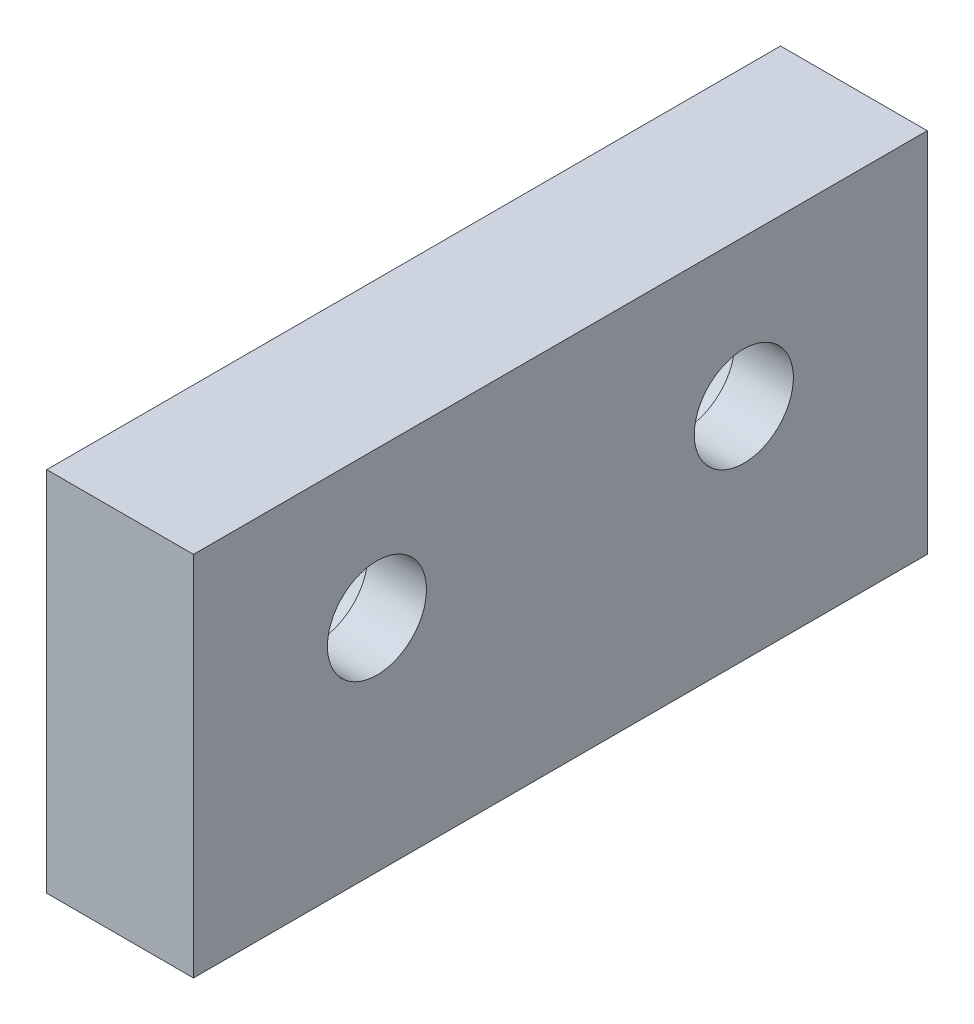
ISO-10303-21;
HEADER;
FILE_DESCRIPTION(('STEP AP214'),'2;1');
FILE_NAME('part.step','',(''),(''),'','','');
FILE_SCHEMA(('AUTOMOTIVE_DESIGN { 1 0 10303 214 1 1 1 1 }'));
ENDSEC;
DATA;
#1=APPLICATION_CONTEXT('core data for automotive mechanical design processes');
#2=APPLICATION_PROTOCOL_DEFINITION('international standard','automotive_design',2000,#1);
#3=PRODUCT_CONTEXT('',#1,'mechanical');
#4=PRODUCT('Part','Part','',(#3));
#5=PRODUCT_RELATED_PRODUCT_CATEGORY('part','',(#4));
#6=PRODUCT_DEFINITION_FORMATION('','',#4);
#7=PRODUCT_DEFINITION_CONTEXT('part definition',#1,'design');
#8=PRODUCT_DEFINITION('design','',#6,#7);
#9=PRODUCT_DEFINITION_SHAPE('','',#8);
#10=(LENGTH_UNIT() NAMED_UNIT(*) SI_UNIT(.MILLI.,.METRE.));
#11=(NAMED_UNIT(*) PLANE_ANGLE_UNIT() SI_UNIT($,.RADIAN.));
#12=(NAMED_UNIT(*) SI_UNIT($,.STERADIAN.) SOLID_ANGLE_UNIT());
#13=UNCERTAINTY_MEASURE_WITH_UNIT(LENGTH_MEASURE(1.E-05),#10,'distance_accuracy_value','');
#14=(GEOMETRIC_REPRESENTATION_CONTEXT(3) GLOBAL_UNCERTAINTY_ASSIGNED_CONTEXT((#13)) GLOBAL_UNIT_ASSIGNED_CONTEXT((#10,
#11,#12)) REPRESENTATION_CONTEXT('',''));
#15=CARTESIAN_POINT('',(0.,0.,0.));
#16=DIRECTION('',(0.,0.,1.));
#17=DIRECTION('',(1.,0.,0.));
#18=AXIS2_PLACEMENT_3D('',#15,#16,#17);
#19=CARTESIAN_POINT('',(-20.,20.,-25.));
#20=DIRECTION('',(-1.,0.,0.));
#21=DIRECTION('',(0.,-1.,0.));
#22=AXIS2_PLACEMENT_3D('',#19,#20,#21);
#23=PLANE('',#22);
#24=CARTESIAN_POINT('',(-20.,0.,0.));
#25=DIRECTION('',(-1.,0.,0.));
#26=DIRECTION('',(0.,0.,1.));
#27=AXIS2_PLACEMENT_3D('',#24,#25,#26);
#28=CIRCLE('',#27,10.);
#29=CARTESIAN_POINT('',(-20.,0.,10.));
#30=VERTEX_POINT('',#29);
#31=EDGE_CURVE('E132',#30,#30,#28,.T.);
#32=ORIENTED_EDGE('',*,*,#31,.F.);
#33=EDGE_LOOP('',(#32));
#34=FACE_BOUND('',#33,.T.);
#35=CARTESIAN_POINT('',(-20.,0.,50.));
#36=DIRECTION('',(-1.,0.,0.));
#37=DIRECTION('',(0.,0.,1.));
#38=AXIS2_PLACEMENT_3D('',#35,#36,#37);
#39=CIRCLE('',#38,10.);
#40=CARTESIAN_POINT('',(-20.,0.,60.));
#41=VERTEX_POINT('',#40);
#42=EDGE_CURVE('E135',#41,#41,#39,.T.);
#43=ORIENTED_EDGE('',*,*,#42,.F.);
#44=EDGE_LOOP('',(#43));
#45=FACE_BOUND('',#44,.T.);
#46=DIRECTION('',(0.,0.,1.));
#47=VECTOR('',#46,1.);
#48=CARTESIAN_POINT('',(-20.,-30.,-25.));
#49=LINE('',#48,#47);
#50=CARTESIAN_POINT('',(-20.,-30.,-25.));
#51=VERTEX_POINT('',#50);
#52=CARTESIAN_POINT('',(-20.,-30.,75.));
#53=VERTEX_POINT('',#52);
#54=EDGE_CURVE('E38',#51,#53,#49,.T.);
#55=ORIENTED_EDGE('',*,*,#54,.T.);
#56=DIRECTION('',(0.,-1.,0.));
#57=VECTOR('',#56,1.);
#58=CARTESIAN_POINT('',(-20.,20.,75.));
#59=LINE('',#58,#57);
#60=CARTESIAN_POINT('',(-20.,20.,75.));
#61=VERTEX_POINT('',#60);
#62=EDGE_CURVE('E75',#61,#53,#59,.T.);
#63=ORIENTED_EDGE('',*,*,#62,.F.);
#64=DIRECTION('',(0.,0.,1.));
#65=VECTOR('',#64,1.);
#66=CARTESIAN_POINT('',(-20.,20.,-25.));
#67=LINE('',#66,#65);
#68=CARTESIAN_POINT('',(-20.,20.,-25.));
#69=VERTEX_POINT('',#68);
#70=EDGE_CURVE('E11',#69,#61,#67,.T.);
#71=ORIENTED_EDGE('',*,*,#70,.F.);
#72=DIRECTION('',(0.,-1.,0.));
#73=VECTOR('',#72,1.);
#74=CARTESIAN_POINT('',(-20.,20.,-25.));
#75=LINE('',#74,#73);
#76=EDGE_CURVE('E76',#69,#51,#75,.T.);
#77=ORIENTED_EDGE('',*,*,#76,.T.);
#78=EDGE_LOOP('',(#55,#63,#71,#77));
#79=FACE_BOUND('',#78,.T.);
#80=ADVANCED_FACE('F35',(#34,#45,#79),#23,.T.);
#81=CARTESIAN_POINT('',(-20.,20.,-25.));
#82=DIRECTION('',(0.,1.,0.));
#83=DIRECTION('',(-1.,0.,0.));
#84=AXIS2_PLACEMENT_3D('',#81,#82,#83);
#85=PLANE('',#84);
#86=ORIENTED_EDGE('',*,*,#70,.T.);
#87=DIRECTION('',(-1.,0.,0.));
#88=VECTOR('',#87,1.);
#89=CARTESIAN_POINT('',(-20.,20.,75.));
#90=LINE('',#89,#88);
#91=CARTESIAN_POINT('',(0.,20.,75.));
#92=VERTEX_POINT('',#91);
#93=EDGE_CURVE('E92',#92,#61,#90,.T.);
#94=ORIENTED_EDGE('',*,*,#93,.F.);
#95=DIRECTION('',(0.,0.,1.));
#96=VECTOR('',#95,1.);
#97=CARTESIAN_POINT('',(0.,20.,-25.));
#98=LINE('',#97,#96);
#99=CARTESIAN_POINT('',(0.,20.,-25.));
#100=VERTEX_POINT('',#99);
#101=EDGE_CURVE('E43',#100,#92,#98,.T.);
#102=ORIENTED_EDGE('',*,*,#101,.F.);
#103=DIRECTION('',(-1.,0.,0.));
#104=VECTOR('',#103,1.);
#105=CARTESIAN_POINT('',(-20.,20.,-25.));
#106=LINE('',#105,#104);
#107=EDGE_CURVE('E81',#100,#69,#106,.T.);
#108=ORIENTED_EDGE('',*,*,#107,.T.);
#109=EDGE_LOOP('',(#86,#94,#102,#108));
#110=FACE_BOUND('',#109,.T.);
#111=ADVANCED_FACE('F112',(#110),#85,.T.);
#112=CARTESIAN_POINT('',(0.,20.,-25.));
#113=DIRECTION('',(1.,0.,0.));
#114=DIRECTION('',(0.,1.,0.));
#115=AXIS2_PLACEMENT_3D('',#112,#113,#114);
#116=PLANE('',#115);
#117=CARTESIAN_POINT('',(0.,0.,0.));
#118=DIRECTION('',(-1.,0.,0.));
#119=DIRECTION('',(0.,0.,1.));
#120=AXIS2_PLACEMENT_3D('',#117,#118,#119);
#121=CIRCLE('',#120,6.75);
#122=CARTESIAN_POINT('',(0.,0.,6.75));
#123=VERTEX_POINT('',#122);
#124=EDGE_CURVE('E138',#123,#123,#121,.T.);
#125=ORIENTED_EDGE('',*,*,#124,.T.);
#126=EDGE_LOOP('',(#125));
#127=FACE_BOUND('',#126,.T.);
#128=CARTESIAN_POINT('',(0.,0.,50.));
#129=DIRECTION('',(-1.,0.,0.));
#130=DIRECTION('',(0.,0.,1.));
#131=AXIS2_PLACEMENT_3D('',#128,#129,#130);
#132=CIRCLE('',#131,6.75);
#133=CARTESIAN_POINT('',(0.,0.,56.75));
#134=VERTEX_POINT('',#133);
#135=EDGE_CURVE('E93',#134,#134,#132,.T.);
#136=ORIENTED_EDGE('',*,*,#135,.T.);
#137=EDGE_LOOP('',(#136));
#138=FACE_BOUND('',#137,.T.);
#139=ORIENTED_EDGE('',*,*,#101,.T.);
#140=DIRECTION('',(0.,1.,0.));
#141=VECTOR('',#140,1.);
#142=CARTESIAN_POINT('',(0.,20.,75.));
#143=LINE('',#142,#141);
#144=CARTESIAN_POINT('',(0.,-30.,75.));
#145=VERTEX_POINT('',#144);
#146=EDGE_CURVE('E88',#145,#92,#143,.T.);
#147=ORIENTED_EDGE('',*,*,#146,.F.);
#148=DIRECTION('',(0.,0.,1.));
#149=VECTOR('',#148,1.);
#150=CARTESIAN_POINT('',(0.,-30.,-25.));
#151=LINE('',#150,#149);
#152=CARTESIAN_POINT('',(0.,-30.,-25.));
#153=VERTEX_POINT('',#152);
#154=EDGE_CURVE('E80',#153,#145,#151,.T.);
#155=ORIENTED_EDGE('',*,*,#154,.F.);
#156=DIRECTION('',(0.,1.,0.));
#157=VECTOR('',#156,1.);
#158=CARTESIAN_POINT('',(0.,20.,-25.));
#159=LINE('',#158,#157);
#160=EDGE_CURVE('E105',#153,#100,#159,.T.);
#161=ORIENTED_EDGE('',*,*,#160,.T.);
#162=EDGE_LOOP('',(#139,#147,#155,#161));
#163=FACE_BOUND('',#162,.T.);
#164=ADVANCED_FACE('F109',(#127,#138,#163),#116,.T.);
#165=CARTESIAN_POINT('',(-20.,-30.,-25.));
#166=DIRECTION('',(0.,-1.,0.));
#167=DIRECTION('',(0.,0.,-1.));
#168=AXIS2_PLACEMENT_3D('',#165,#166,#167);
#169=PLANE('',#168);
#170=ORIENTED_EDGE('',*,*,#154,.T.);
#171=DIRECTION('',(1.,0.,0.));
#172=VECTOR('',#171,1.);
#173=CARTESIAN_POINT('',(-20.,-30.,75.));
#174=LINE('',#173,#172);
#175=EDGE_CURVE('E83',#53,#145,#174,.T.);
#176=ORIENTED_EDGE('',*,*,#175,.F.);
#177=ORIENTED_EDGE('',*,*,#54,.F.);
#178=DIRECTION('',(1.,0.,0.));
#179=VECTOR('',#178,1.);
#180=CARTESIAN_POINT('',(-20.,-30.,-25.));
#181=LINE('',#180,#179);
#182=EDGE_CURVE('E103',#51,#153,#181,.T.);
#183=ORIENTED_EDGE('',*,*,#182,.T.);
#184=EDGE_LOOP('',(#170,#176,#177,#183));
#185=FACE_BOUND('',#184,.T.);
#186=ADVANCED_FACE('F84',(#185),#169,.T.);
#187=CARTESIAN_POINT('',(-20.,-30.,-25.));
#188=DIRECTION('',(0.,0.,1.));
#189=DIRECTION('',(1.,0.,0.));
#190=AXIS2_PLACEMENT_3D('',#187,#188,#189);
#191=PLANE('',#190);
#192=ORIENTED_EDGE('',*,*,#76,.F.);
#193=ORIENTED_EDGE('',*,*,#107,.F.);
#194=ORIENTED_EDGE('',*,*,#160,.F.);
#195=ORIENTED_EDGE('',*,*,#182,.F.);
#196=EDGE_LOOP('',(#192,#193,#194,#195));
#197=FACE_BOUND('',#196,.T.);
#198=ADVANCED_FACE('F114',(#197),#191,.F.);
#199=CARTESIAN_POINT('',(-20.,-30.,75.));
#200=DIRECTION('',(0.,0.,1.));
#201=DIRECTION('',(1.,0.,0.));
#202=AXIS2_PLACEMENT_3D('',#199,#200,#201);
#203=PLANE('',#202);
#204=ORIENTED_EDGE('',*,*,#62,.T.);
#205=ORIENTED_EDGE('',*,*,#175,.T.);
#206=ORIENTED_EDGE('',*,*,#146,.T.);
#207=ORIENTED_EDGE('',*,*,#93,.T.);
#208=EDGE_LOOP('',(#204,#205,#206,#207));
#209=FACE_BOUND('',#208,.T.);
#210=ADVANCED_FACE('F91',(#209),#203,.T.);
#211=CARTESIAN_POINT('',(-20.,0.,50.));
#212=DIRECTION('',(-1.,0.,0.));
#213=DIRECTION('',(0.,0.,1.));
#214=AXIS2_PLACEMENT_3D('',#211,#212,#213);
#215=CYLINDRICAL_SURFACE('',#214,6.75);
#216=ORIENTED_EDGE('',*,*,#135,.F.);
#217=EDGE_LOOP('',(#216));
#218=FACE_BOUND('',#217,.T.);
#219=CARTESIAN_POINT('',(-8.,0.,50.));
#220=DIRECTION('',(-1.,0.,0.));
#221=DIRECTION('',(0.,0.,1.));
#222=AXIS2_PLACEMENT_3D('',#219,#220,#221);
#223=CIRCLE('',#222,6.75);
#224=CARTESIAN_POINT('',(-8.,0.,56.75));
#225=VERTEX_POINT('',#224);
#226=EDGE_CURVE('E96',#225,#225,#223,.T.);
#227=ORIENTED_EDGE('',*,*,#226,.T.);
#228=EDGE_LOOP('',(#227));
#229=FACE_BOUND('',#228,.T.);
#230=ADVANCED_FACE('F121',(#218,#229),#215,.F.);
#231=CARTESIAN_POINT('',(-8.,6.75,50.));
#232=DIRECTION('',(1.,0.,0.));
#233=DIRECTION('',(0.,0.,-1.));
#234=AXIS2_PLACEMENT_3D('',#231,#232,#233);
#235=PLANE('',#234);
#236=ORIENTED_EDGE('',*,*,#226,.F.);
#237=EDGE_LOOP('',(#236));
#238=FACE_BOUND('',#237,.T.);
#239=CARTESIAN_POINT('',(-8.,0.,50.));
#240=DIRECTION('',(-1.,0.,0.));
#241=DIRECTION('',(0.,0.,1.));
#242=AXIS2_PLACEMENT_3D('',#239,#240,#241);
#243=CIRCLE('',#242,10.);
#244=CARTESIAN_POINT('',(-8.,0.,60.));
#245=VERTEX_POINT('',#244);
#246=EDGE_CURVE('E137',#245,#245,#243,.T.);
#247=ORIENTED_EDGE('',*,*,#246,.T.);
#248=EDGE_LOOP('',(#247));
#249=FACE_BOUND('',#248,.T.);
#250=ADVANCED_FACE('F150',(#238,#249),#235,.F.);
#251=CARTESIAN_POINT('',(-20.,0.,50.));
#252=DIRECTION('',(-1.,0.,0.));
#253=DIRECTION('',(0.,0.,1.));
#254=AXIS2_PLACEMENT_3D('',#251,#252,#253);
#255=CYLINDRICAL_SURFACE('',#254,10.);
#256=ORIENTED_EDGE('',*,*,#246,.F.);
#257=EDGE_LOOP('',(#256));
#258=FACE_BOUND('',#257,.T.);
#259=ORIENTED_EDGE('',*,*,#42,.T.);
#260=EDGE_LOOP('',(#259));
#261=FACE_BOUND('',#260,.T.);
#262=ADVANCED_FACE('F153',(#258,#261),#255,.F.);
#263=CARTESIAN_POINT('',(-20.,0.,0.));
#264=DIRECTION('',(-1.,0.,0.));
#265=DIRECTION('',(0.,0.,1.));
#266=AXIS2_PLACEMENT_3D('',#263,#264,#265);
#267=CYLINDRICAL_SURFACE('',#266,6.75);
#268=ORIENTED_EDGE('',*,*,#124,.F.);
#269=EDGE_LOOP('',(#268));
#270=FACE_BOUND('',#269,.T.);
#271=CARTESIAN_POINT('',(-8.,0.,0.));
#272=DIRECTION('',(-1.,0.,0.));
#273=DIRECTION('',(0.,0.,1.));
#274=AXIS2_PLACEMENT_3D('',#271,#272,#273);
#275=CIRCLE('',#274,6.75);
#276=CARTESIAN_POINT('',(-8.,0.,6.75));
#277=VERTEX_POINT('',#276);
#278=EDGE_CURVE('E143',#277,#277,#275,.T.);
#279=ORIENTED_EDGE('',*,*,#278,.T.);
#280=EDGE_LOOP('',(#279));
#281=FACE_BOUND('',#280,.T.);
#282=ADVANCED_FACE('F158',(#270,#281),#267,.F.);
#283=CARTESIAN_POINT('',(-8.,6.75,0.));
#284=DIRECTION('',(1.,0.,0.));
#285=DIRECTION('',(0.,0.,-1.));
#286=AXIS2_PLACEMENT_3D('',#283,#284,#285);
#287=PLANE('',#286);
#288=ORIENTED_EDGE('',*,*,#278,.F.);
#289=EDGE_LOOP('',(#288));
#290=FACE_BOUND('',#289,.T.);
#291=CARTESIAN_POINT('',(-8.,0.,0.));
#292=DIRECTION('',(-1.,0.,0.));
#293=DIRECTION('',(0.,0.,1.));
#294=AXIS2_PLACEMENT_3D('',#291,#292,#293);
#295=CIRCLE('',#294,10.);
#296=CARTESIAN_POINT('',(-8.,0.,10.));
#297=VERTEX_POINT('',#296);
#298=EDGE_CURVE('E184',#297,#297,#295,.T.);
#299=ORIENTED_EDGE('',*,*,#298,.T.);
#300=EDGE_LOOP('',(#299));
#301=FACE_BOUND('',#300,.T.);
#302=ADVANCED_FACE('F163',(#290,#301),#287,.F.);
#303=CARTESIAN_POINT('',(-20.,0.,0.));
#304=DIRECTION('',(-1.,0.,0.));
#305=DIRECTION('',(0.,0.,1.));
#306=AXIS2_PLACEMENT_3D('',#303,#304,#305);
#307=CYLINDRICAL_SURFACE('',#306,10.);
#308=ORIENTED_EDGE('',*,*,#298,.F.);
#309=EDGE_LOOP('',(#308));
#310=FACE_BOUND('',#309,.T.);
#311=ORIENTED_EDGE('',*,*,#31,.T.);
#312=EDGE_LOOP('',(#311));
#313=FACE_BOUND('',#312,.T.);
#314=ADVANCED_FACE('F189',(#310,#313),#307,.F.);
#315=CLOSED_SHELL('',(#80,#111,#164,#186,#198,#210,#230,#250,#262,#282,#302,#314));
#316=MANIFOLD_SOLID_BREP('B2',#315);
#317=ADVANCED_BREP_SHAPE_REPRESENTATION('',(#18,#316),#14);
#318=SHAPE_DEFINITION_REPRESENTATION(#9,#317);
ENDSEC;
END-ISO-10303-21;
